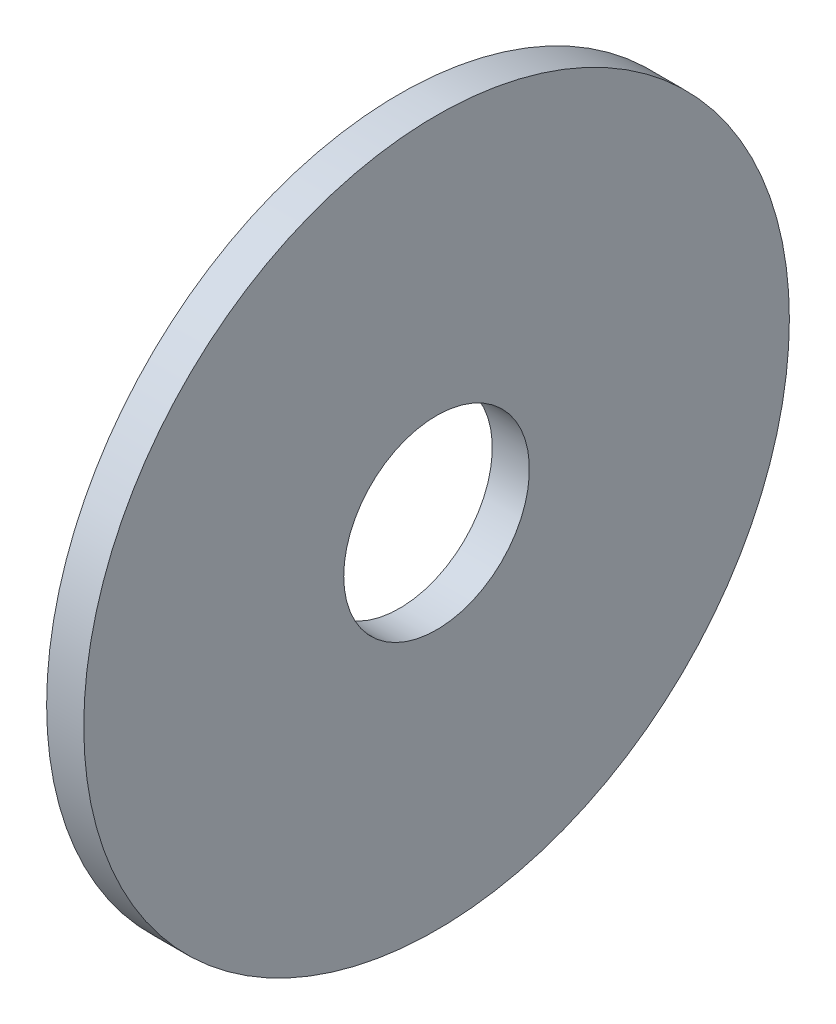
ISO-10303-21;
HEADER;
FILE_DESCRIPTION(('STEP AP214'),'2;1');
FILE_NAME('part.step','',(''),(''),'','','');
FILE_SCHEMA(('AUTOMOTIVE_DESIGN { 1 0 10303 214 1 1 1 1 }'));
ENDSEC;
DATA;
#1=APPLICATION_CONTEXT('core data for automotive mechanical design processes');
#2=APPLICATION_PROTOCOL_DEFINITION('international standard','automotive_design',2000,#1);
#3=PRODUCT_CONTEXT('',#1,'mechanical');
#4=PRODUCT('Part','Part','',(#3));
#5=PRODUCT_RELATED_PRODUCT_CATEGORY('part','',(#4));
#6=PRODUCT_DEFINITION_FORMATION('','',#4);
#7=PRODUCT_DEFINITION_CONTEXT('part definition',#1,'design');
#8=PRODUCT_DEFINITION('design','',#6,#7);
#9=PRODUCT_DEFINITION_SHAPE('','',#8);
#10=(LENGTH_UNIT() NAMED_UNIT(*) SI_UNIT(.MILLI.,.METRE.));
#11=(NAMED_UNIT(*) PLANE_ANGLE_UNIT() SI_UNIT($,.RADIAN.));
#12=(NAMED_UNIT(*) SI_UNIT($,.STERADIAN.) SOLID_ANGLE_UNIT());
#13=UNCERTAINTY_MEASURE_WITH_UNIT(LENGTH_MEASURE(1.E-05),#10,'distance_accuracy_value','');
#14=(GEOMETRIC_REPRESENTATION_CONTEXT(3) GLOBAL_UNCERTAINTY_ASSIGNED_CONTEXT((#13)) GLOBAL_UNIT_ASSIGNED_CONTEXT((#10,
#11,#12)) REPRESENTATION_CONTEXT('',''));
#15=CARTESIAN_POINT('',(0.,0.,0.));
#16=DIRECTION('',(0.,0.,1.));
#17=DIRECTION('',(1.,0.,0.));
#18=AXIS2_PLACEMENT_3D('',#15,#16,#17);
#19=CARTESIAN_POINT('',(0.,0.,-28.5));
#20=DIRECTION('',(1.,0.,0.));
#21=DIRECTION('',(0.,0.,-1.));
#22=AXIS2_PLACEMENT_3D('',#19,#20,#21);
#23=PLANE('',#22);
#24=CARTESIAN_POINT('',(0.,0.,0.));
#25=DIRECTION('',(-1.,0.,0.));
#26=DIRECTION('',(0.,0.,1.));
#27=AXIS2_PLACEMENT_3D('',#24,#25,#26);
#28=CIRCLE('',#27,7.5);
#29=CARTESIAN_POINT('',(0.,0.,7.5));
#30=VERTEX_POINT('',#29);
#31=EDGE_CURVE('E10',#30,#30,#28,.T.);
#32=ORIENTED_EDGE('',*,*,#31,.F.);
#33=EDGE_LOOP('',(#32));
#34=FACE_BOUND('',#33,.T.);
#35=CARTESIAN_POINT('',(0.,0.,0.));
#36=DIRECTION('',(-1.,0.,0.));
#37=DIRECTION('',(0.,0.,1.));
#38=AXIS2_PLACEMENT_3D('',#35,#36,#37);
#39=CIRCLE('',#38,28.5);
#40=CARTESIAN_POINT('',(0.,0.,28.5));
#41=VERTEX_POINT('',#40);
#42=EDGE_CURVE('E46',#41,#41,#39,.T.);
#43=ORIENTED_EDGE('',*,*,#42,.T.);
#44=EDGE_LOOP('',(#43));
#45=FACE_BOUND('',#44,.T.);
#46=ADVANCED_FACE('F32',(#34,#45),#23,.F.);
#47=CARTESIAN_POINT('',(0.,0.,0.));
#48=DIRECTION('',(-1.,0.,0.));
#49=DIRECTION('',(0.,0.,1.));
#50=AXIS2_PLACEMENT_3D('',#47,#48,#49);
#51=CYLINDRICAL_SURFACE('',#50,7.5);
#52=CARTESIAN_POINT('',(3.,0.,0.));
#53=DIRECTION('',(-1.,0.,0.));
#54=DIRECTION('',(0.,0.,1.));
#55=AXIS2_PLACEMENT_3D('',#52,#53,#54);
#56=CIRCLE('',#55,7.5);
#57=CARTESIAN_POINT('',(3.,0.,7.5));
#58=VERTEX_POINT('',#57);
#59=EDGE_CURVE('E38',#58,#58,#56,.T.);
#60=ORIENTED_EDGE('',*,*,#59,.F.);
#61=EDGE_LOOP('',(#60));
#62=FACE_BOUND('',#61,.T.);
#63=ORIENTED_EDGE('',*,*,#31,.T.);
#64=EDGE_LOOP('',(#63));
#65=FACE_BOUND('',#64,.T.);
#66=ADVANCED_FACE('F61',(#62,#65),#51,.F.);
#67=CARTESIAN_POINT('',(3.,0.,-28.5));
#68=DIRECTION('',(-1.,0.,0.));
#69=DIRECTION('',(0.,0.,1.));
#70=AXIS2_PLACEMENT_3D('',#67,#68,#69);
#71=PLANE('',#70);
#72=CARTESIAN_POINT('',(3.,0.,0.));
#73=DIRECTION('',(-1.,0.,0.));
#74=DIRECTION('',(0.,0.,1.));
#75=AXIS2_PLACEMENT_3D('',#72,#73,#74);
#76=CIRCLE('',#75,28.5);
#77=CARTESIAN_POINT('',(3.,0.,28.5));
#78=VERTEX_POINT('',#77);
#79=EDGE_CURVE('E42',#78,#78,#76,.T.);
#80=ORIENTED_EDGE('',*,*,#79,.F.);
#81=EDGE_LOOP('',(#80));
#82=FACE_BOUND('',#81,.T.);
#83=ORIENTED_EDGE('',*,*,#59,.T.);
#84=EDGE_LOOP('',(#83));
#85=FACE_BOUND('',#84,.T.);
#86=ADVANCED_FACE('F56',(#82,#85),#71,.F.);
#87=CARTESIAN_POINT('',(0.,0.,0.));
#88=DIRECTION('',(-1.,0.,0.));
#89=DIRECTION('',(0.,0.,1.));
#90=AXIS2_PLACEMENT_3D('',#87,#88,#89);
#91=CYLINDRICAL_SURFACE('',#90,28.5);
#92=ORIENTED_EDGE('',*,*,#42,.F.);
#93=EDGE_LOOP('',(#92));
#94=FACE_BOUND('',#93,.T.);
#95=ORIENTED_EDGE('',*,*,#79,.T.);
#96=EDGE_LOOP('',(#95));
#97=FACE_BOUND('',#96,.T.);
#98=ADVANCED_FACE('F53',(#94,#97),#91,.T.);
#99=CLOSED_SHELL('',(#46,#66,#86,#98));
#100=MANIFOLD_SOLID_BREP('B2',#99);
#101=ADVANCED_BREP_SHAPE_REPRESENTATION('',(#18,#100),#14);
#102=SHAPE_DEFINITION_REPRESENTATION(#9,#101);
ENDSEC;
END-ISO-10303-21;
